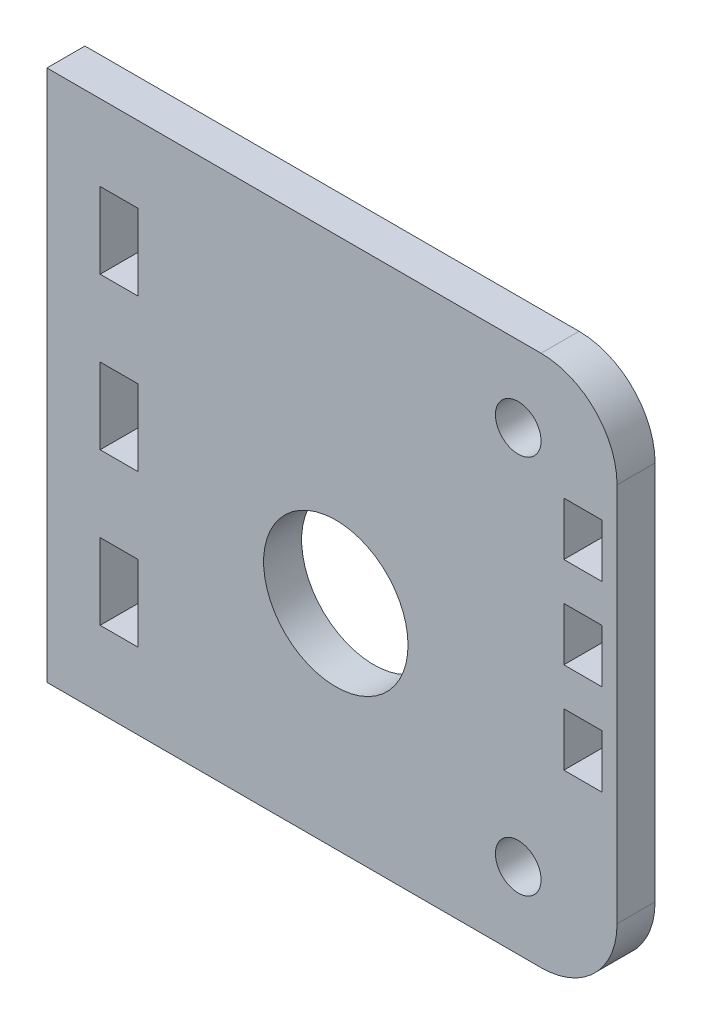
from build123d import *

# Parameters (mm, degrees)
ESQUISSE1_W             = 30
ESQUISSE1_H             = 70
BOSS_EXTRU_1_DEPTH      = 5
ESQUISSE3_W             = 5
ESQUISSE3_H             = 10
ENL_V_MAT_EXTRU_2_DEPTH = 10
ESQUISSE4_W             = 5
ESQUISSE4_H             = 70
BOSS_EXTRU_2_DEPTH      = 25
ESQUISSE5_R             = 3
ENL_V_MAT_EXTRU_3_DEPTH = 5
CONG_1_R                = 10
ESQUISSE6_W             = 30
ESQUISSE6_H             = 70
ENL_V_MAT_EXTRU_4_DEPTH = 10
ESQUISSE7_W             = 5
ESQUISSE7_H             = 70
BOSS_EXTRU_3_DEPTH      = 50
ESQUISSE8_R             = 4.6
ENL_V_MAT_EXTRU_5_DEPTH = 50
ESQUISSE9_W             = 5
ESQUISSE9_H             = 7
ENL_V_MAT_EXTRU_6_DEPTH = 10
ESQUISSE10_W            = 5
ESQUISSE10_H            = 10
ENL_V_MAT_EXTRU_7_DEPTH = 10
ESQUISSE11_R            = 9.5
ENL_V_MAT_EXTRU_8_DEPTH = 30


with BuildPart() as part:
    # Esquisse1 → Boss.-Extru.1 (new body)
    with BuildSketch(Plane.XY):
        with Locations((-15, 0)):
            Rectangle(ESQUISSE1_W, ESQUISSE1_H)
    extrude(amount=BOSS_EXTRU_1_DEPTH)

    # Esquisse3 → Enl_v. mat.-Extru.2 (cut)
    with BuildSketch(Plane.XY.offset(5)):
        with Locations((-2.5, -30)):
            Rectangle(ESQUISSE3_W, ESQUISSE3_H)
        with Locations((-2.5, -10)):
            Rectangle(ESQUISSE3_W, ESQUISSE3_H)
        with Locations((-2.5, 10)):
            Rectangle(ESQUISSE3_W, ESQUISSE3_H)
        with Locations((-2.5, 30)):
            Rectangle(ESQUISSE3_W, ESQUISSE3_H)
    extrude(amount=-ENL_V_MAT_EXTRU_2_DEPTH, mode=Mode.SUBTRACT)

    # Esquisse4 → Boss.-Extru.2 (add)
    with BuildSketch(Plane(origin=(0, 0, 0), x_dir=(0, 0, -1), z_dir=(1, 0, 0))):
        with Locations((-2.5, 0)):
            Rectangle(ESQUISSE4_W, ESQUISSE4_H)
    extrude(amount=BOSS_EXTRU_2_DEPTH)

    # Esquisse5 → Enl_v. mat.-Extru.3 (cut)
    with BuildSketch(Plane.XY.offset(5)):
        with Locations((12, 25)):
            Circle(ESQUISSE5_R)
        with Locations((12, -25)):
            Circle(ESQUISSE5_R)
    extrude(amount=-ENL_V_MAT_EXTRU_3_DEPTH, mode=Mode.SUBTRACT)

    # Cong_1
    cong_1_edges = [part.edges().sort_by_distance(p)[0] for p in [
        (25, -35, 2.5),
        (25, 35, 2.5),
    ]]
    fillet(cong_1_edges, radius=CONG_1_R)

    # Esquisse6 → Enl_v. mat.-Extru.4 (cut)
    with BuildSketch(Plane.XY.offset(5)):
        with Locations((-15, 0)):
            Rectangle(ESQUISSE6_W, ESQUISSE6_H)
    extrude(amount=-ENL_V_MAT_EXTRU_4_DEPTH, mode=Mode.SUBTRACT)

    # Esquisse7 → Boss.-Extru.3 (add)
    with BuildSketch(Plane.ZY):
        with Locations((2.5, 0)):
            Rectangle(ESQUISSE7_W, ESQUISSE7_H)
    extrude(amount=BOSS_EXTRU_3_DEPTH)

    # Esquisse8 → Enl_v. mat.-Extru.5 (cut)
    with BuildSketch(Plane.XY.offset(5)):
        with Locations((-12, -7)):
            Circle(ESQUISSE8_R)
    extrude(amount=-ENL_V_MAT_EXTRU_5_DEPTH, mode=Mode.SUBTRACT)

    # Esquisse9 → Enl_v. mat.-Extru.6 (cut)
    with BuildSketch(Plane.XY.offset(5)):
        with Locations((20.5, 16.5)):
            Rectangle(ESQUISSE9_W, ESQUISSE9_H)
        with Locations((20.5, 4.5)):
            Rectangle(ESQUISSE9_W, ESQUISSE9_H)
        with Locations((20.5, -7.5)):
            Rectangle(ESQUISSE9_W, ESQUISSE9_H)
    extrude(amount=-ENL_V_MAT_EXTRU_6_DEPTH, mode=Mode.SUBTRACT)

    # Esquisse10 → Enl_v. mat.-Extru.7 (cut)
    with BuildSketch(Plane.XY.offset(5)):
        with Locations((-40.5, 20)):
            Rectangle(ESQUISSE10_W, ESQUISSE10_H)
        with Locations((-40.5, 0)):
            Rectangle(ESQUISSE10_W, ESQUISSE10_H)
        with Locations((-40.5, -20)):
            Rectangle(ESQUISSE10_W, ESQUISSE10_H)
    extrude(amount=-ENL_V_MAT_EXTRU_7_DEPTH, mode=Mode.SUBTRACT)

    # Esquisse11 → Enl_v. mat.-Extru.8 (cut)
    with BuildSketch(Plane.XY.offset(5)):
        with Locations((-12, -7)):
            Circle(ESQUISSE11_R)
    extrude(amount=-ENL_V_MAT_EXTRU_8_DEPTH, mode=Mode.SUBTRACT)


solid = part.part
